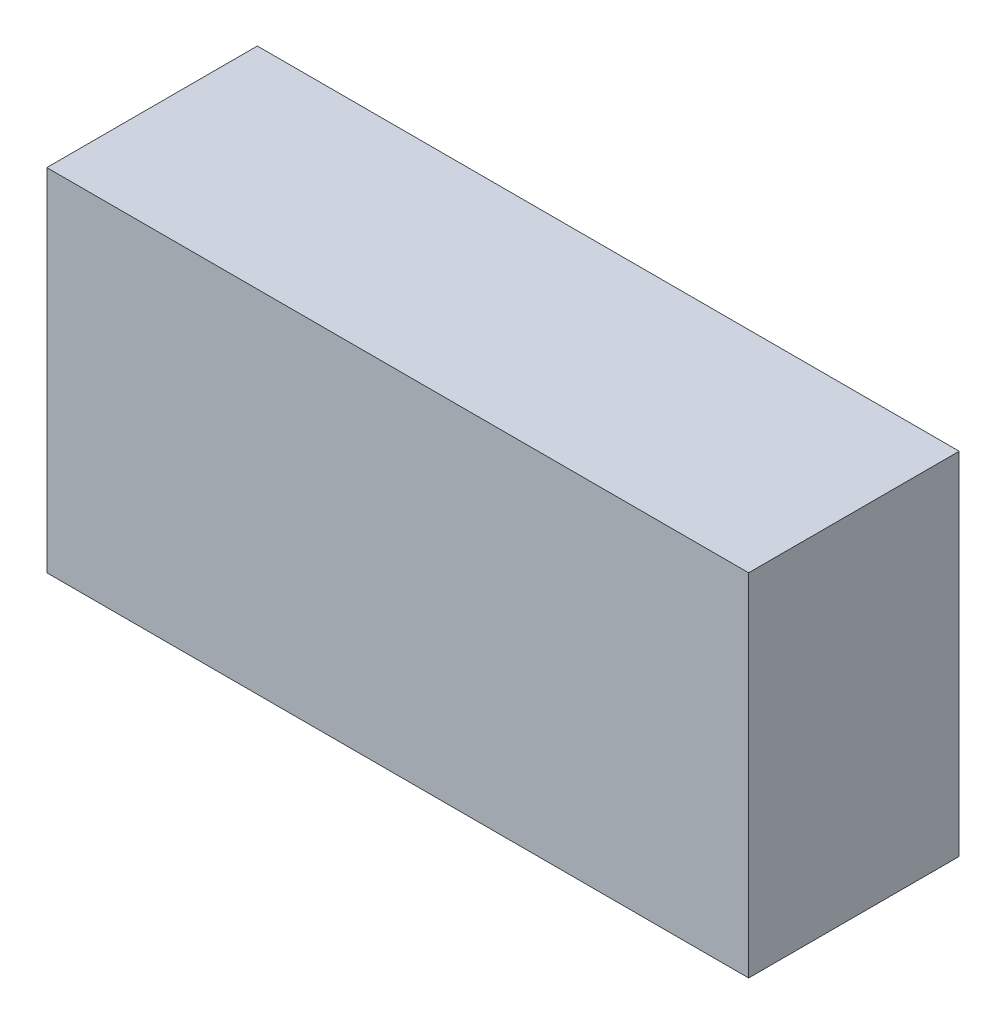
from build123d import *

# Parameters (mm, degrees)
SKIZZE1_W                       = 100
SKIZZE1_H                       = 30
AUFSATZ_LINEAR_AUSTRAGEN1_DEPTH = 50


with BuildPart() as part:
    # Skizze1 → Aufsatz-Linear austragen1 (new body)
    with BuildSketch(Plane(origin=(0, 0, 0), x_dir=(1, 0, 0), z_dir=(0, 1, 0))):
        Rectangle(SKIZZE1_W, SKIZZE1_H)
    extrude(amount=AUFSATZ_LINEAR_AUSTRAGEN1_DEPTH)


solid = part.part
